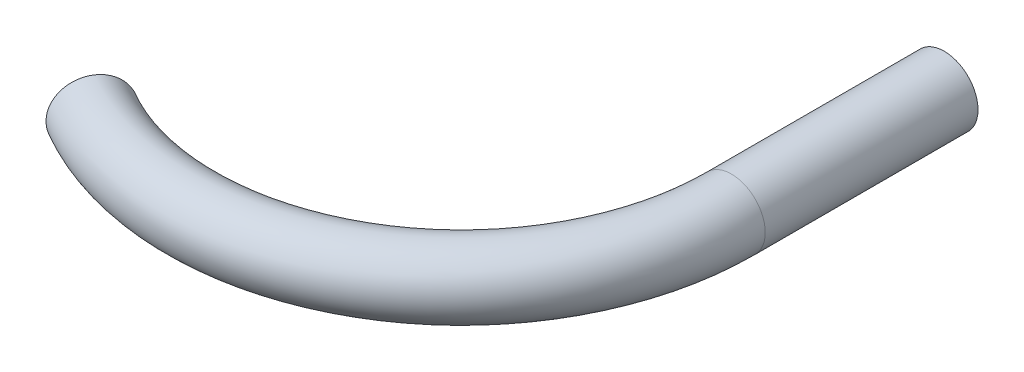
ISO-10303-21;
HEADER;
FILE_DESCRIPTION(('STEP AP214'),'2;1');
FILE_NAME('part.step','',(''),(''),'','','');
FILE_SCHEMA(('AUTOMOTIVE_DESIGN { 1 0 10303 214 1 1 1 1 }'));
ENDSEC;
DATA;
#1=APPLICATION_CONTEXT('core data for automotive mechanical design processes');
#2=APPLICATION_PROTOCOL_DEFINITION('international standard','automotive_design',2000,#1);
#3=PRODUCT_CONTEXT('',#1,'mechanical');
#4=PRODUCT('Part','Part','',(#3));
#5=PRODUCT_RELATED_PRODUCT_CATEGORY('part','',(#4));
#6=PRODUCT_DEFINITION_FORMATION('','',#4);
#7=PRODUCT_DEFINITION_CONTEXT('part definition',#1,'design');
#8=PRODUCT_DEFINITION('design','',#6,#7);
#9=PRODUCT_DEFINITION_SHAPE('','',#8);
#10=(LENGTH_UNIT() NAMED_UNIT(*) SI_UNIT(.MILLI.,.METRE.));
#11=(NAMED_UNIT(*) PLANE_ANGLE_UNIT() SI_UNIT($,.RADIAN.));
#12=(NAMED_UNIT(*) SI_UNIT($,.STERADIAN.) SOLID_ANGLE_UNIT());
#13=UNCERTAINTY_MEASURE_WITH_UNIT(LENGTH_MEASURE(1.E-05),#10,'distance_accuracy_value','');
#14=(GEOMETRIC_REPRESENTATION_CONTEXT(3) GLOBAL_UNCERTAINTY_ASSIGNED_CONTEXT((#13)) GLOBAL_UNIT_ASSIGNED_CONTEXT((#10,
#11,#12)) REPRESENTATION_CONTEXT('',''));
#15=CARTESIAN_POINT('',(0.,0.,0.));
#16=DIRECTION('',(0.,0.,1.));
#17=DIRECTION('',(1.,0.,0.));
#18=AXIS2_PLACEMENT_3D('',#15,#16,#17);
#19=CARTESIAN_POINT('',(0.,0.,0.));
#20=DIRECTION('',(0.,1.,0.));
#21=DIRECTION('',(0.,0.,1.));
#22=AXIS2_PLACEMENT_3D('',#19,#20,#21);
#23=TOROIDAL_SURFACE('',#22,12.7,0.793749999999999);
#24=CARTESIAN_POINT('',(-6.35000000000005,0.,10.9985226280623));
#25=DIRECTION('',(-0.866025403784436,0.,-0.500000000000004));
#26=DIRECTION('',(-0.500000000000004,0.,0.866025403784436));
#27=AXIS2_PLACEMENT_3D('',#24,#25,#26);
#28=CIRCLE('',#27,0.793749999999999);
#29=CARTESIAN_POINT('',(-6.74687500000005,0.,11.6859302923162));
#30=VERTEX_POINT('',#29);
#31=EDGE_CURVE('E40',#30,#30,#28,.T.);
#32=CARTESIAN_POINT('',(12.7,0.,0.));
#33=DIRECTION('',(0.,0.,1.));
#34=DIRECTION('',(1.,0.,0.));
#35=AXIS2_PLACEMENT_3D('',#32,#33,#34);
#36=CIRCLE('',#35,0.793749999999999);
#37=CARTESIAN_POINT('',(13.49375,0.,0.));
#38=VERTEX_POINT('',#37);
#39=EDGE_CURVE('E48',#38,#38,#36,.T.);
#40=CARTESIAN_POINT('',(0.,0.,0.));
#41=DIRECTION('',(0.,1.,0.));
#42=DIRECTION('',(0.,0.,1.));
#43=AXIS2_PLACEMENT_3D('',#40,#41,#42);
#44=CIRCLE('',#43,13.49375);
#45=EDGE_CURVE('',#30,#38,#44,.T.);
#46=ORIENTED_EDGE('',*,*,#31,.T.);
#47=ORIENTED_EDGE('',*,*,#39,.F.);
#48=ORIENTED_EDGE('',*,*,#45,.T.);
#49=ORIENTED_EDGE('',*,*,#45,.F.);
#50=EDGE_LOOP('',(#46,#48,#47,#49));
#51=FACE_BOUND('',#50,.T.);
#52=ADVANCED_FACE('F33',(#51),#23,.F.);
#53=CARTESIAN_POINT('',(0.,0.,0.));
#54=DIRECTION('',(0.,1.,0.));
#55=DIRECTION('',(0.,0.,1.));
#56=AXIS2_PLACEMENT_3D('',#53,#54,#55);
#57=TOROIDAL_SURFACE('',#56,12.7,1.5875);
#58=CARTESIAN_POINT('',(-6.35000000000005,0.,10.9985226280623));
#59=DIRECTION('',(-0.866025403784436,0.,-0.500000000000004));
#60=DIRECTION('',(-0.500000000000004,0.,0.866025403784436));
#61=AXIS2_PLACEMENT_3D('',#58,#59,#60);
#62=CIRCLE('',#61,1.5875);
#63=CARTESIAN_POINT('',(-7.14375000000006,0.,12.3733379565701));
#64=VERTEX_POINT('',#63);
#65=EDGE_CURVE('E10',#64,#64,#62,.T.);
#66=CARTESIAN_POINT('',(12.7,0.,0.));
#67=DIRECTION('',(0.,0.,1.));
#68=DIRECTION('',(1.,0.,0.));
#69=AXIS2_PLACEMENT_3D('',#66,#67,#68);
#70=CIRCLE('',#69,1.5875);
#71=CARTESIAN_POINT('',(14.2875,0.,0.));
#72=VERTEX_POINT('',#71);
#73=EDGE_CURVE('E44',#72,#72,#70,.T.);
#74=CARTESIAN_POINT('',(0.,0.,0.));
#75=DIRECTION('',(0.,1.,0.));
#76=DIRECTION('',(0.,0.,1.));
#77=AXIS2_PLACEMENT_3D('',#74,#75,#76);
#78=CIRCLE('',#77,14.2875);
#79=EDGE_CURVE('',#64,#72,#78,.T.);
#80=ORIENTED_EDGE('',*,*,#65,.F.);
#81=ORIENTED_EDGE('',*,*,#73,.T.);
#82=ORIENTED_EDGE('',*,*,#79,.T.);
#83=ORIENTED_EDGE('',*,*,#79,.F.);
#84=EDGE_LOOP('',(#80,#82,#81,#83));
#85=FACE_BOUND('',#84,.T.);
#86=ADVANCED_FACE('F35',(#85),#57,.T.);
#87=CARTESIAN_POINT('',(-6.35000000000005,0.,10.9985226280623));
#88=DIRECTION('',(-0.866025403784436,0.,-0.500000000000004));
#89=DIRECTION('',(-0.500000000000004,0.,0.866025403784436));
#90=AXIS2_PLACEMENT_3D('',#87,#88,#89);
#91=PLANE('',#90);
#92=ORIENTED_EDGE('',*,*,#31,.F.);
#93=EDGE_LOOP('',(#92));
#94=FACE_BOUND('',#93,.T.);
#95=ORIENTED_EDGE('',*,*,#65,.T.);
#96=EDGE_LOOP('',(#95));
#97=FACE_BOUND('',#96,.T.);
#98=ADVANCED_FACE('F66',(#94,#97),#91,.T.);
#99=CARTESIAN_POINT('',(12.7,0.,-10.));
#100=DIRECTION('',(0.,0.,-1.));
#101=DIRECTION('',(-1.,0.,0.));
#102=AXIS2_PLACEMENT_3D('',#99,#100,#101);
#103=PLANE('',#102);
#104=CARTESIAN_POINT('',(12.7,0.,-10.));
#105=DIRECTION('',(0.,0.,-1.));
#106=DIRECTION('',(-1.,0.,0.));
#107=AXIS2_PLACEMENT_3D('',#104,#105,#106);
#108=CIRCLE('',#107,1.5875);
#109=CARTESIAN_POINT('',(11.1125,0.,-10.));
#110=VERTEX_POINT('',#109);
#111=EDGE_CURVE('E53',#110,#110,#108,.T.);
#112=ORIENTED_EDGE('',*,*,#111,.T.);
#113=EDGE_LOOP('',(#112));
#114=FACE_BOUND('',#113,.T.);
#115=CARTESIAN_POINT('',(12.7,0.,-10.));
#116=DIRECTION('',(0.,0.,-1.));
#117=DIRECTION('',(-1.,0.,0.));
#118=AXIS2_PLACEMENT_3D('',#115,#116,#117);
#119=CIRCLE('',#118,0.793749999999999);
#120=CARTESIAN_POINT('',(11.90625,0.,-10.));
#121=VERTEX_POINT('',#120);
#122=EDGE_CURVE('E56',#121,#121,#119,.T.);
#123=ORIENTED_EDGE('',*,*,#122,.F.);
#124=EDGE_LOOP('',(#123));
#125=FACE_BOUND('',#124,.T.);
#126=ADVANCED_FACE('F63',(#114,#125),#103,.T.);
#127=CARTESIAN_POINT('',(12.7,0.,-10.));
#128=DIRECTION('',(0.,0.,1.));
#129=DIRECTION('',(1.,0.,0.));
#130=AXIS2_PLACEMENT_3D('',#127,#128,#129);
#131=CYLINDRICAL_SURFACE('',#130,1.5875);
#132=ORIENTED_EDGE('',*,*,#111,.F.);
#133=EDGE_LOOP('',(#132));
#134=FACE_BOUND('',#133,.T.);
#135=ORIENTED_EDGE('',*,*,#73,.F.);
#136=EDGE_LOOP('',(#135));
#137=FACE_BOUND('',#136,.T.);
#138=ADVANCED_FACE('F65',(#134,#137),#131,.T.);
#139=CARTESIAN_POINT('',(12.7,0.,-10.));
#140=DIRECTION('',(0.,0.,1.));
#141=DIRECTION('',(1.,0.,0.));
#142=AXIS2_PLACEMENT_3D('',#139,#140,#141);
#143=CYLINDRICAL_SURFACE('',#142,0.793749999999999);
#144=ORIENTED_EDGE('',*,*,#122,.T.);
#145=EDGE_LOOP('',(#144));
#146=FACE_BOUND('',#145,.T.);
#147=ORIENTED_EDGE('',*,*,#39,.T.);
#148=EDGE_LOOP('',(#147));
#149=FACE_BOUND('',#148,.T.);
#150=ADVANCED_FACE('F60',(#146,#149),#143,.F.);
#151=CLOSED_SHELL('',(#52,#86,#98,#126,#138,#150));
#152=MANIFOLD_SOLID_BREP('B2',#151);
#153=ADVANCED_BREP_SHAPE_REPRESENTATION('',(#18,#152),#14);
#154=SHAPE_DEFINITION_REPRESENTATION(#9,#153);
ENDSEC;
END-ISO-10303-21;
